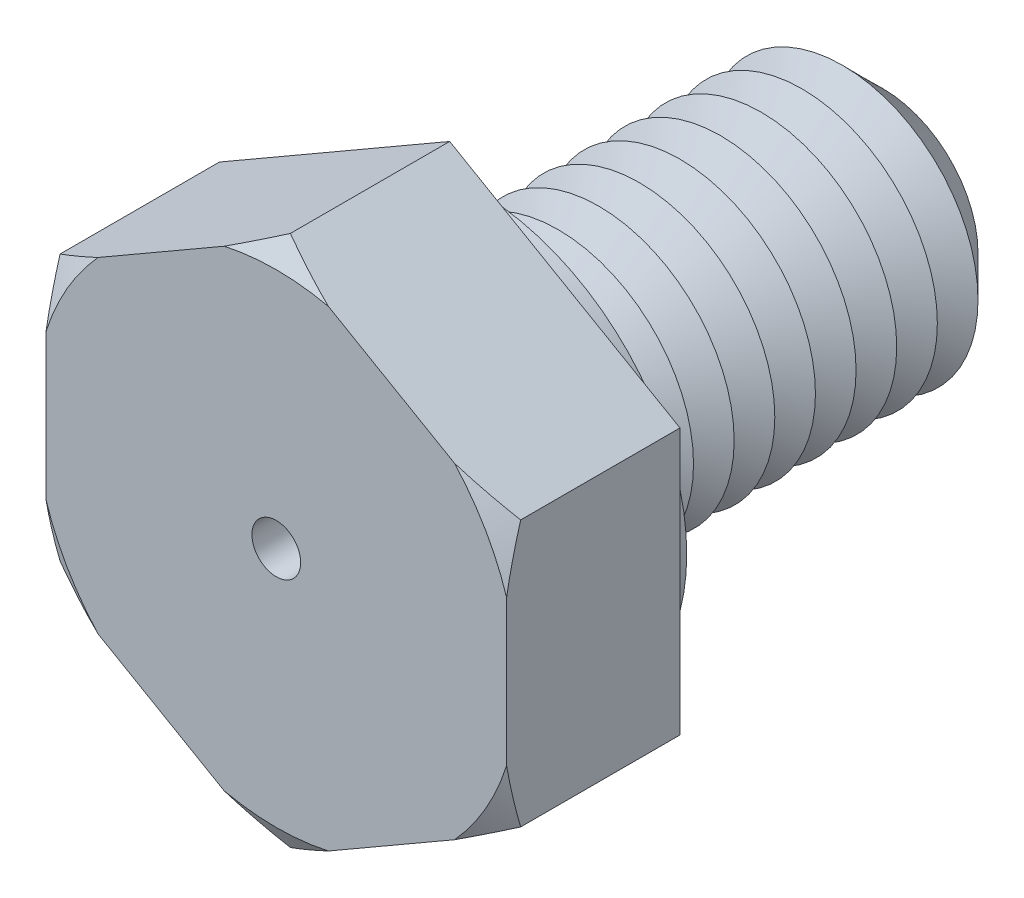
ISO-10303-21;
HEADER;
FILE_DESCRIPTION(('STEP AP214'),'2;1');
FILE_NAME('part.step','',(''),(''),'','','');
FILE_SCHEMA(('AUTOMOTIVE_DESIGN { 1 0 10303 214 1 1 1 1 }'));
ENDSEC;
DATA;
#1=APPLICATION_CONTEXT('core data for automotive mechanical design processes');
#2=APPLICATION_PROTOCOL_DEFINITION('international standard','automotive_design',2000,#1);
#3=PRODUCT_CONTEXT('',#1,'mechanical');
#4=PRODUCT('Part','Part','',(#3));
#5=PRODUCT_RELATED_PRODUCT_CATEGORY('part','',(#4));
#6=PRODUCT_DEFINITION_FORMATION('','',#4);
#7=PRODUCT_DEFINITION_CONTEXT('part definition',#1,'design');
#8=PRODUCT_DEFINITION('design','',#6,#7);
#9=PRODUCT_DEFINITION_SHAPE('','',#8);
#10=(LENGTH_UNIT() NAMED_UNIT(*) SI_UNIT(.MILLI.,.METRE.));
#11=(NAMED_UNIT(*) PLANE_ANGLE_UNIT() SI_UNIT($,.RADIAN.));
#12=(NAMED_UNIT(*) SI_UNIT($,.STERADIAN.) SOLID_ANGLE_UNIT());
#13=UNCERTAINTY_MEASURE_WITH_UNIT(LENGTH_MEASURE(1.E-05),#10,'distance_accuracy_value','');
#14=(GEOMETRIC_REPRESENTATION_CONTEXT(3) GLOBAL_UNCERTAINTY_ASSIGNED_CONTEXT((#13)) GLOBAL_UNIT_ASSIGNED_CONTEXT((#10,
#11,#12)) REPRESENTATION_CONTEXT('',''));
#15=CARTESIAN_POINT('',(0.,0.,0.));
#16=DIRECTION('',(0.,0.,1.));
#17=DIRECTION('',(1.,0.,0.));
#18=AXIS2_PLACEMENT_3D('',#15,#16,#17);
#19=CARTESIAN_POINT('',(8.5,4.90747728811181,6.4));
#20=DIRECTION('',(-0.5,-0.866025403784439,0.));
#21=DIRECTION('',(0.866025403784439,-0.5,0.));
#22=AXIS2_PLACEMENT_3D('',#19,#20,#21);
#23=PLANE('',#22);
#24=CARTESIAN_POINT('',(14.3974196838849,1.50260044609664,3.18954977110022));
#25=CARTESIAN_POINT('',(14.1303849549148,1.65677301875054,3.33361874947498));
#26=CARTESIAN_POINT('',(13.8627107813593,1.81131477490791,3.47613168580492));
#27=CARTESIAN_POINT('',(13.3258139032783,2.12129233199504,3.75731467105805));
#28=CARTESIAN_POINT('',(13.0565910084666,2.27672824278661,3.89598423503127));
#29=CARTESIAN_POINT('',(12.5155257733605,2.58911240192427,4.16915145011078));
#30=CARTESIAN_POINT('',(12.2436777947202,2.74606390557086,4.30363425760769));
#31=CARTESIAN_POINT('',(11.697943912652,3.06114350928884,4.56695627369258));
#32=CARTESIAN_POINT('',(11.4240580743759,3.21927157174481,4.69579566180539));
#33=CARTESIAN_POINT('',(10.8669438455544,3.54092162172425,4.94977636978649));
#34=CARTESIAN_POINT('',(10.5836547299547,3.70447866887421,5.07474091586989));
#35=CARTESIAN_POINT('',(10.0142178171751,4.03324322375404,5.31575754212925));
#36=CARTESIAN_POINT('',(9.72806988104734,4.19845081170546,5.43180918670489));
#37=CARTESIAN_POINT('',(9.15284957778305,4.53055440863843,5.6527883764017));
#38=CARTESIAN_POINT('',(8.86378033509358,4.69744861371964,5.75772666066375));
#39=CARTESIAN_POINT('',(8.28224800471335,5.03319646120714,5.95405449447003));
#40=CARTESIAN_POINT('',(7.98978536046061,5.20204984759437,6.04544579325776));
#41=CARTESIAN_POINT('',(7.29029341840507,5.60590170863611,6.24311258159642));
#42=CARTESIAN_POINT('',(6.88163396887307,5.84184135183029,6.34201308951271));
#43=CARTESIAN_POINT('',(6.2644717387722,6.1981601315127,6.46082851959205));
#44=CARTESIAN_POINT('',(6.05806549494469,6.31732883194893,6.49551015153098));
#45=CARTESIAN_POINT('',(5.64409758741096,6.55633331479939,6.55416143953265));
#46=CARTESIAN_POINT('',(5.43653593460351,6.67616909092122,6.57813119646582));
#47=CARTESIAN_POINT('',(5.02306823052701,6.914884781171,6.6144556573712));
#48=CARTESIAN_POINT('',(4.81717088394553,7.03375966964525,6.62694180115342));
#49=CARTESIAN_POINT('',(4.40509314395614,7.27167286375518,6.64040244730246));
#50=CARTESIAN_POINT('',(4.19891275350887,7.39071116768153,6.64137706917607));
#51=CARTESIAN_POINT('',(3.78675559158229,7.62867021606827,6.63178359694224));
#52=CARTESIAN_POINT('',(3.58077881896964,7.747590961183,6.62121556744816));
#53=CARTESIAN_POINT('',(3.16946579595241,7.9850626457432,6.58885652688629));
#54=CARTESIAN_POINT('',(2.96412965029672,8.10361352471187,6.56706376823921));
#55=CARTESIAN_POINT('',(2.47890311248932,8.38375919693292,6.50285520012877));
#56=CARTESIAN_POINT('',(2.19947000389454,8.54508997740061,6.45579627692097));
#57=CARTESIAN_POINT('',(1.6432817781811,8.86620539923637,6.34397240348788));
#58=CARTESIAN_POINT('',(1.36652705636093,9.02598981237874,6.27920487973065));
#59=CARTESIAN_POINT('',(0.815728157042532,9.34399370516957,6.13440902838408));
#60=CARTESIAN_POINT('',(0.541687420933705,9.50221119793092,6.05436342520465));
#61=CARTESIAN_POINT('',(-0.00331670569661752,9.81686947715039,5.88153285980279));
#62=CARTESIAN_POINT('',(-0.274280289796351,9.97331037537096,5.788748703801));
#63=CARTESIAN_POINT('',(-0.816522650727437,10.2863741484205,5.59147835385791));
#64=CARTESIAN_POINT('',(-1.08776675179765,10.4429770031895,5.48686595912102));
#65=CARTESIAN_POINT('',(-1.62738149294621,10.7545237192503,5.26886764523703));
#66=CARTESIAN_POINT('',(-1.89575390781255,10.9094686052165,5.15548754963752));
#67=CARTESIAN_POINT('',(-2.43005320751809,11.2179464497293,4.92150983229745));
#68=CARTESIAN_POINT('',(-2.69598059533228,11.3714796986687,4.80091373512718));
#69=CARTESIAN_POINT('',(-3.22575115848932,11.6773428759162,4.55376737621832));
#70=CARTESIAN_POINT('',(-3.48959429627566,11.829672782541,4.42721700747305));
#71=CARTESIAN_POINT('',(-3.9337259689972,12.0860923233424,4.20929972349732));
#72=CARTESIAN_POINT('',(-4.11449197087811,12.1904576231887,4.11922480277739));
#73=CARTESIAN_POINT('',(-4.47523725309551,12.3987340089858,3.93701701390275));
#74=CARTESIAN_POINT('',(-4.6552165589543,12.5026451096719,3.84488421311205));
#75=CARTESIAN_POINT('',(-5.01258669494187,12.7089728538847,3.65977671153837));
#76=CARTESIAN_POINT('',(-5.18998489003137,12.8113937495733,3.56682094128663));
#77=CARTESIAN_POINT('',(-5.54415606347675,13.0158745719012,3.3793246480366));
#78=CARTESIAN_POINT('',(-5.72092903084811,13.1179344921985,3.28478409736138));
#79=CARTESIAN_POINT('',(-5.89741968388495,13.2198314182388,3.18954977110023));
#80=B_SPLINE_CURVE_WITH_KNOTS('',3,(#24,#25,#26,#27,#28,#29,#30,#31,#32,#33,#34,#35,#36,#37,#38,
#39,#40,#41,#42,#43,#44,#45,#46,#47,#48,#49,#50,#51,#52,#53,#54,#55,#56,#57,#58,#59,#60,#61,#62,
#63,#64,#65,#66,#67,#68,#69,#70,#71,#72,#73,#74,#75,#76,#77,#78,#79),.UNSPECIFIED.,.F.,.F.,(4,2,
2,2,2,2,2,2,2,2,2,2,2,2,2,2,2,2,2,2,2,2,2,2,2,2,2,4),(0.,1.02103660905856,2.04220146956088,
3.06664888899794,4.09106369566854,5.1414707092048,6.19192902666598,7.24136281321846,
8.29066097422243,9.73548564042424,10.45782862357,11.1801648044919,11.8941264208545,
12.6080806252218,13.3220308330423,14.036092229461,15.0137259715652,15.9915018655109,
16.9703899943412,17.9492161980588,18.939699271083,19.9295300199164,20.9191523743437,
21.9087925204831,22.5907917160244,23.272768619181,23.947601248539,24.622445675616),.UNSPECIFIED.);
#81=CARTESIAN_POINT('',(8.5,4.90747728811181,5.88038475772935));
#82=VERTEX_POINT('',#81);
#83=CARTESIAN_POINT('',(6.57804882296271,6.01711631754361,6.4));
#84=VERTEX_POINT('',#83);
#85=EDGE_CURVE('E132',#82,#84,#80,.T.);
#86=ORIENTED_EDGE('',*,*,#85,.F.);
#87=DIRECTION('',(0.,0.,-1.));
#88=VECTOR('',#87,1.);
#89=CARTESIAN_POINT('',(8.5,4.90747728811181,6.4));
#90=LINE('',#89,#88);
#91=CARTESIAN_POINT('',(8.5,4.90747728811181,0.));
#92=VERTEX_POINT('',#91);
#93=EDGE_CURVE('E144',#82,#92,#90,.T.);
#94=ORIENTED_EDGE('',*,*,#93,.T.);
#95=DIRECTION('',(-0.866025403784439,0.5,0.));
#96=VECTOR('',#95,1.);
#97=CARTESIAN_POINT('',(8.5,4.90747728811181,0.));
#98=LINE('',#97,#96);
#99=CARTESIAN_POINT('',(0.,9.81495457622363,0.));
#100=VERTEX_POINT('',#99);
#101=EDGE_CURVE('E236',#92,#100,#98,.T.);
#102=ORIENTED_EDGE('',*,*,#101,.T.);
#103=DIRECTION('',(0.,0.,-1.));
#104=VECTOR('',#103,1.);
#105=CARTESIAN_POINT('',(0.,9.81495457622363,6.4));
#106=LINE('',#105,#104);
#107=CARTESIAN_POINT('',(0.,9.81495457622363,5.88038475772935));
#108=VERTEX_POINT('',#107);
#109=EDGE_CURVE('E179',#108,#100,#106,.T.);
#110=ORIENTED_EDGE('',*,*,#109,.F.);
#111=CARTESIAN_POINT('',(1.92195117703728,8.70531554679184,6.4));
#112=VERTEX_POINT('',#111);
#113=EDGE_CURVE('E151',#112,#108,#80,.T.);
#114=ORIENTED_EDGE('',*,*,#113,.F.);
#115=DIRECTION('',(-0.866025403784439,0.5,0.));
#116=VECTOR('',#115,1.);
#117=CARTESIAN_POINT('',(8.5,4.90747728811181,6.4));
#118=LINE('',#117,#116);
#119=EDGE_CURVE('E148',#84,#112,#118,.T.);
#120=ORIENTED_EDGE('',*,*,#119,.F.);
#121=EDGE_LOOP('',(#86,#94,#102,#110,#114,#120));
#122=FACE_BOUND('',#121,.T.);
#123=ADVANCED_FACE('F39',(#122),#23,.F.);
#124=CARTESIAN_POINT('',(0.,9.81495457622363,6.4));
#125=DIRECTION('',(0.5,-0.866025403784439,0.));
#126=DIRECTION('',(0.866025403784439,0.5,0.));
#127=AXIS2_PLACEMENT_3D('',#124,#125,#126);
#128=PLANE('',#127);
#129=CARTESIAN_POINT('',(5.89741968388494,13.2198314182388,3.18954977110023));
#130=CARTESIAN_POINT('',(5.63038495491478,13.0656588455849,3.33361874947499));
#131=CARTESIAN_POINT('',(5.36271078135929,12.9111170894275,3.47613168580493));
#132=CARTESIAN_POINT('',(4.82581390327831,12.6011395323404,3.75731467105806));
#133=CARTESIAN_POINT('',(4.55659100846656,12.4457036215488,3.89598423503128));
#134=CARTESIAN_POINT('',(4.01552577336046,12.1333194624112,4.16915145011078));
#135=CARTESIAN_POINT('',(3.74367779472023,11.9763679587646,4.30363425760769));
#136=CARTESIAN_POINT('',(3.19794391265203,11.6612883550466,4.56695627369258));
#137=CARTESIAN_POINT('',(2.92405807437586,11.5031602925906,4.69579566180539));
#138=CARTESIAN_POINT('',(2.3669438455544,11.1815102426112,4.9497763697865));
#139=CARTESIAN_POINT('',(2.08365472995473,11.0179531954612,5.0747409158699));
#140=CARTESIAN_POINT('',(1.51421781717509,10.6891886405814,5.31575754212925));
#141=CARTESIAN_POINT('',(1.22806988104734,10.52398105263,5.4318091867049));
#142=CARTESIAN_POINT('',(0.652849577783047,10.191877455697,5.6527883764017));
#143=CARTESIAN_POINT('',(0.363780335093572,10.0249832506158,5.75772666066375));
#144=CARTESIAN_POINT('',(-0.21775199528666,9.6892354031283,5.95405449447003));
#145=CARTESIAN_POINT('',(-0.510214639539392,9.52038201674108,6.04544579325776));
#146=CARTESIAN_POINT('',(-1.20970658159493,9.11653015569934,6.24311258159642));
#147=CARTESIAN_POINT('',(-1.61836603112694,8.88059051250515,6.34201308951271));
#148=CARTESIAN_POINT('',(-2.2355282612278,8.52427173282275,6.46082851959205));
#149=CARTESIAN_POINT('',(-2.44193450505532,8.40510303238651,6.49551015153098));
#150=CARTESIAN_POINT('',(-2.85590241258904,8.16609854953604,6.55416143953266));
#151=CARTESIAN_POINT('',(-3.0634640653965,8.04626277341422,6.57813119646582));
#152=CARTESIAN_POINT('',(-3.47693176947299,7.80754708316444,6.6144556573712));
#153=CARTESIAN_POINT('',(-3.68282911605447,7.68867219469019,6.62694180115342));
#154=CARTESIAN_POINT('',(-4.09490685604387,7.45075900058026,6.64040244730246));
#155=CARTESIAN_POINT('',(-4.30108724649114,7.33172069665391,6.64137706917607));
#156=CARTESIAN_POINT('',(-4.71324440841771,7.09376164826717,6.63178359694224));
#157=CARTESIAN_POINT('',(-4.91922118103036,6.97484090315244,6.62121556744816));
#158=CARTESIAN_POINT('',(-5.3305342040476,6.73736921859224,6.58885652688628));
#159=CARTESIAN_POINT('',(-5.53587034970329,6.61881833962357,6.5670637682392));
#160=CARTESIAN_POINT('',(-6.02109688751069,6.33867266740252,6.50285520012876));
#161=CARTESIAN_POINT('',(-6.30052999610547,6.17734188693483,6.45579627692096));
#162=CARTESIAN_POINT('',(-6.85671822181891,5.85622646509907,6.34397240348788));
#163=CARTESIAN_POINT('',(-7.13347294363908,5.6964420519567,6.27920487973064));
#164=CARTESIAN_POINT('',(-7.68427184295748,5.37843815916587,6.13440902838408));
#165=CARTESIAN_POINT('',(-7.9583125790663,5.22022066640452,6.05436342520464));
#166=CARTESIAN_POINT('',(-8.50331670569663,4.90556238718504,5.88153285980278));
#167=CARTESIAN_POINT('',(-8.77428028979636,4.74912148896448,5.78874870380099));
#168=CARTESIAN_POINT('',(-9.31652265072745,4.4360577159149,5.59147835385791));
#169=CARTESIAN_POINT('',(-9.58776675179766,4.27945486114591,5.48686595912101));
#170=CARTESIAN_POINT('',(-10.1273814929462,3.9679081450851,5.26886764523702));
#171=CARTESIAN_POINT('',(-10.3957539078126,3.81296325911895,5.15548754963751));
#172=CARTESIAN_POINT('',(-10.9300532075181,3.50448541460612,4.92150983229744));
#173=CARTESIAN_POINT('',(-11.1959805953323,3.35095216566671,4.80091373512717));
#174=CARTESIAN_POINT('',(-11.7257511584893,3.04508898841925,4.55376737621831));
#175=CARTESIAN_POINT('',(-11.9895942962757,2.89275908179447,4.42721700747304));
#176=CARTESIAN_POINT('',(-12.4337259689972,2.63633954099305,4.20929972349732));
#177=CARTESIAN_POINT('',(-12.6144919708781,2.53197424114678,4.11922480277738));
#178=CARTESIAN_POINT('',(-12.9752372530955,2.32369785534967,3.93701701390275));
#179=CARTESIAN_POINT('',(-13.1552165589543,2.21978675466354,3.84488421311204));
#180=CARTESIAN_POINT('',(-13.5125866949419,2.01345901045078,3.65977671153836));
#181=CARTESIAN_POINT('',(-13.6899848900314,1.91103811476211,3.56682094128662));
#182=CARTESIAN_POINT('',(-14.0441560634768,1.70655729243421,3.37932464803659));
#183=CARTESIAN_POINT('',(-14.2209290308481,1.60449737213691,3.28478409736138));
#184=CARTESIAN_POINT('',(-14.3974196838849,1.50260044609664,3.18954977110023));
#185=B_SPLINE_CURVE_WITH_KNOTS('',3,(#129,#130,#131,#132,#133,#134,#135,#136,#137,#138,#139,
#140,#141,#142,#143,#144,#145,#146,#147,#148,#149,#150,#151,#152,#153,#154,#155,#156,#157,#158,
#159,#160,#161,#162,#163,#164,#165,#166,#167,#168,#169,#170,#171,#172,#173,#174,#175,#176,#177,
#178,#179,#180,#181,#182,#183,#184),.UNSPECIFIED.,.F.,.F.,(4,2,2,2,2,2,2,2,2,2,2,2,2,2,2,2,2,2,
2,2,2,2,2,2,2,2,2,4),(0.,1.02103660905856,2.04220146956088,3.06664888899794,4.09106369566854,
5.14147070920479,6.19192902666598,7.24136281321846,8.29066097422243,9.73548564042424,
10.45782862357,11.1801648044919,11.8941264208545,12.6080806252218,13.3220308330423,
14.036092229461,15.0137259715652,15.991501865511,16.9703899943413,17.9492161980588,
18.939699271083,19.9295300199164,20.9191523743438,21.9087925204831,22.5907917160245,
23.272768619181,23.947601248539,24.622445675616),.UNSPECIFIED.);
#186=CARTESIAN_POINT('',(-1.92195117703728,8.70531554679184,6.4));
#187=VERTEX_POINT('',#186);
#188=EDGE_CURVE('E341',#108,#187,#185,.T.);
#189=ORIENTED_EDGE('',*,*,#188,.F.);
#190=ORIENTED_EDGE('',*,*,#109,.T.);
#191=DIRECTION('',(-0.866025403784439,-0.5,0.));
#192=VECTOR('',#191,1.);
#193=CARTESIAN_POINT('',(0.,9.81495457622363,0.));
#194=LINE('',#193,#192);
#195=CARTESIAN_POINT('',(-8.5,4.90747728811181,0.));
#196=VERTEX_POINT('',#195);
#197=EDGE_CURVE('E239',#100,#196,#194,.T.);
#198=ORIENTED_EDGE('',*,*,#197,.T.);
#199=DIRECTION('',(0.,0.,-1.));
#200=VECTOR('',#199,1.);
#201=CARTESIAN_POINT('',(-8.5,4.90747728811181,6.4));
#202=LINE('',#201,#200);
#203=CARTESIAN_POINT('',(-8.5,4.90747728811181,5.88038475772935));
#204=VERTEX_POINT('',#203);
#205=EDGE_CURVE('E176',#204,#196,#202,.T.);
#206=ORIENTED_EDGE('',*,*,#205,.F.);
#207=CARTESIAN_POINT('',(-6.57804882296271,6.01711631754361,6.4));
#208=VERTEX_POINT('',#207);
#209=EDGE_CURVE('E333',#208,#204,#185,.T.);
#210=ORIENTED_EDGE('',*,*,#209,.F.);
#211=DIRECTION('',(-0.866025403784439,-0.5,0.));
#212=VECTOR('',#211,1.);
#213=CARTESIAN_POINT('',(0.,9.81495457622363,6.4));
#214=LINE('',#213,#212);
#215=EDGE_CURVE('E213',#187,#208,#214,.T.);
#216=ORIENTED_EDGE('',*,*,#215,.F.);
#217=EDGE_LOOP('',(#189,#190,#198,#206,#210,#216));
#218=FACE_BOUND('',#217,.T.);
#219=ADVANCED_FACE('F347',(#218),#128,.F.);
#220=CARTESIAN_POINT('',(-8.5,4.90747728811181,6.4));
#221=DIRECTION('',(1.,0.,0.));
#222=DIRECTION('',(0.,0.,-1.));
#223=AXIS2_PLACEMENT_3D('',#220,#221,#222);
#224=PLANE('',#223);
#225=CARTESIAN_POINT('',(-8.5,10.8048969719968,3.60988571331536));
#226=CARTESIAN_POINT('',(-8.5,10.4978348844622,3.74918346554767));
#227=CARTESIAN_POINT('',(-8.5,10.189932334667,3.88666386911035));
#228=CARTESIAN_POINT('',(-8.5,9.57208629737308,4.15710808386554));
#229=CARTESIAN_POINT('',(-8.5,9.26214245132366,4.29007107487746));
#230=CARTESIAN_POINT('',(-8.5,8.6386633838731,4.55109231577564));
#231=CARTESIAN_POINT('',(-8.5,8.32511856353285,4.67912772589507));
#232=CARTESIAN_POINT('',(-8.5,7.69537699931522,4.92848462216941));
#233=CARTESIAN_POINT('',(-8.5,7.37918037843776,5.04980641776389));
#234=CARTESIAN_POINT('',(-8.5,6.74517674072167,5.28371307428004));
#235=CARTESIAN_POINT('',(-8.5,6.42738342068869,5.39633487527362));
#236=CARTESIAN_POINT('',(-8.5,5.78839893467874,5.61161420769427));
#237=CARTESIAN_POINT('',(-8.5,5.46720760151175,5.7142712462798));
#238=CARTESIAN_POINT('',(-8.5,4.82159629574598,5.90726308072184));
#239=CARTESIAN_POINT('',(-8.5,4.49718135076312,5.99761456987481));
#240=CARTESIAN_POINT('',(-8.5,3.84456693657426,6.16359045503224));
#241=CARTESIAN_POINT('',(-8.5,3.51636763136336,6.23921548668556));
#242=CARTESIAN_POINT('',(-8.5,2.94974096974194,6.35404738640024));
#243=CARTESIAN_POINT('',(-8.5,2.7121746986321,6.39750509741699));
#244=CARTESIAN_POINT('',(-8.5,2.23545236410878,6.47441576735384));
#245=CARTESIAN_POINT('',(-8.5,1.99629657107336,6.50787038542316));
#246=CARTESIAN_POINT('',(-8.5,1.51674855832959,6.56389930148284));
#247=CARTESIAN_POINT('',(-8.5,1.27635657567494,6.58647561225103));
#248=CARTESIAN_POINT('',(-8.5,0.794760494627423,6.62010098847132));
#249=CARTESIAN_POINT('',(-8.5,0.553556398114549,6.63115008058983));
#250=CARTESIAN_POINT('',(-8.5,0.0710159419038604,6.64137634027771));
#251=CARTESIAN_POINT('',(-8.5,-0.170320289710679,6.64055949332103));
#252=CARTESIAN_POINT('',(-8.5,-0.65265778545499,6.62709447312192));
#253=CARTESIAN_POINT('',(-8.5,-0.893659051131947,6.6144463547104));
#254=CARTESIAN_POINT('',(-8.5,-1.37480632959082,6.57770491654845));
#255=CARTESIAN_POINT('',(-8.5,-1.61495224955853,6.55361039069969));
#256=CARTESIAN_POINT('',(-8.5,-2.09391419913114,6.49466927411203));
#257=CARTESIAN_POINT('',(-8.5,-2.33273017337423,6.4598222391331));
#258=CARTESIAN_POINT('',(-8.5,-2.92716537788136,6.36046793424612));
#259=CARTESIAN_POINT('',(-8.5,-3.28176466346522,6.28983043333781));
#260=CARTESIAN_POINT('',(-8.5,-3.98672843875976,6.12983266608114));
#261=CARTESIAN_POINT('',(-8.5,-4.3370917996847,6.0404675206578));
#262=CARTESIAN_POINT('',(-8.5,-5.0342542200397,5.84616571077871));
#263=CARTESIAN_POINT('',(-8.5,-5.3810438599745,5.74119557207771));
#264=CARTESIAN_POINT('',(-8.5,-6.07054103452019,5.51879279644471));
#265=CARTESIAN_POINT('',(-8.5,-6.41324885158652,5.40136102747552));
#266=CARTESIAN_POINT('',(-8.5,-7.09891821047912,5.15508322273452));
#267=CARTESIAN_POINT('',(-8.5,-7.44183833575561,5.02612259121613));
#268=CARTESIAN_POINT('',(-8.5,-8.12447486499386,4.75996128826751));
#269=CARTESIAN_POINT('',(-8.5,-8.46419106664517,4.62276010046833));
#270=CARTESIAN_POINT('',(-8.5,-9.13876623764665,4.34260011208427));
#271=CARTESIAN_POINT('',(-8.5,-9.47364225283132,4.19968216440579));
#272=CARTESIAN_POINT('',(-8.5,-10.1409696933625,3.90850505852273));
#273=CARTESIAN_POINT('',(-8.5,-10.4734216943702,3.76024722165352));
#274=CARTESIAN_POINT('',(-8.5,-10.8048969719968,3.60988571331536));
#275=B_SPLINE_CURVE_WITH_KNOTS('',3,(#225,#226,#227,#228,#229,#230,#231,#232,#233,#234,#235,
#236,#237,#238,#239,#240,#241,#242,#243,#244,#245,#246,#247,#248,#249,#250,#251,#252,#253,#254,
#255,#256,#257,#258,#259,#260,#261,#262,#263,#264,#265,#266,#267,#268,#269,#270,#271,#272,#273,
#274),.UNSPECIFIED.,.F.,.F.,(4,2,2,2,2,2,2,2,2,2,2,2,2,2,2,2,2,2,2,2,2,2,2,2,4),(0.,
1.01155870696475,2.02330010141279,3.03927305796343,4.05519914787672,5.06654285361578,
6.07793655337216,7.08794426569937,8.09790837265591,8.82224854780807,9.5464685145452,
10.2705544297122,10.9946386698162,11.7183576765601,12.4420733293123,13.1658652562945,
13.8896870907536,14.9737367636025,16.0580692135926,17.1447621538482,18.2313794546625,
19.3303511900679,20.4293918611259,21.5216359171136,22.6136115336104),.UNSPECIFIED.);
#276=CARTESIAN_POINT('',(-8.5,2.68819922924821,6.4));
#277=VERTEX_POINT('',#276);
#278=EDGE_CURVE('E220',#204,#277,#275,.T.);
#279=ORIENTED_EDGE('',*,*,#278,.F.);
#280=ORIENTED_EDGE('',*,*,#205,.T.);
#281=DIRECTION('',(0.,-1.,0.));
#282=VECTOR('',#281,1.);
#283=CARTESIAN_POINT('',(-8.5,4.90747728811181,0.));
#284=LINE('',#283,#282);
#285=CARTESIAN_POINT('',(-8.5,-4.90747728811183,0.));
#286=VERTEX_POINT('',#285);
#287=EDGE_CURVE('E244',#196,#286,#284,.T.);
#288=ORIENTED_EDGE('',*,*,#287,.T.);
#289=DIRECTION('',(0.,0.,-1.));
#290=VECTOR('',#289,1.);
#291=CARTESIAN_POINT('',(-8.5,-4.90747728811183,6.4));
#292=LINE('',#291,#290);
#293=CARTESIAN_POINT('',(-8.49999999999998,-4.90747728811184,5.88038475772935));
#294=VERTEX_POINT('',#293);
#295=EDGE_CURVE('E173',#294,#286,#292,.T.);
#296=ORIENTED_EDGE('',*,*,#295,.F.);
#297=CARTESIAN_POINT('',(-8.5,-2.68819922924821,6.4));
#298=VERTEX_POINT('',#297);
#299=EDGE_CURVE('E223',#298,#294,#275,.T.);
#300=ORIENTED_EDGE('',*,*,#299,.F.);
#301=DIRECTION('',(0.,-1.,0.));
#302=VECTOR('',#301,1.);
#303=CARTESIAN_POINT('',(-8.5,4.90747728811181,6.4));
#304=LINE('',#303,#302);
#305=EDGE_CURVE('E211',#277,#298,#304,.T.);
#306=ORIENTED_EDGE('',*,*,#305,.F.);
#307=EDGE_LOOP('',(#279,#280,#288,#296,#300,#306));
#308=FACE_BOUND('',#307,.T.);
#309=ADVANCED_FACE('F219',(#308),#224,.F.);
#310=CARTESIAN_POINT('',(-8.5,-4.90747728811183,6.4));
#311=DIRECTION('',(0.5,0.866025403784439,0.));
#312=DIRECTION('',(-0.866025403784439,0.5,0.));
#313=AXIS2_PLACEMENT_3D('',#310,#311,#312);
#314=PLANE('',#313);
#315=CARTESIAN_POINT('',(-14.3974196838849,-1.50260044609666,3.18954977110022));
#316=CARTESIAN_POINT('',(-14.1303849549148,-1.65677301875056,3.33361874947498));
#317=CARTESIAN_POINT('',(-13.8627107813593,-1.81131477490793,3.47613168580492));
#318=CARTESIAN_POINT('',(-13.3258139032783,-2.12129233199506,3.75731467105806));
#319=CARTESIAN_POINT('',(-13.0565910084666,-2.27672824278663,3.89598423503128));
#320=CARTESIAN_POINT('',(-12.5155257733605,-2.58911240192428,4.16915145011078));
#321=CARTESIAN_POINT('',(-12.2436777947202,-2.74606390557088,4.30363425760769));
#322=CARTESIAN_POINT('',(-11.697943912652,-3.06114350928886,4.56695627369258));
#323=CARTESIAN_POINT('',(-11.4240580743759,-3.21927157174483,4.69579566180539));
#324=CARTESIAN_POINT('',(-10.8669438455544,-3.54092162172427,4.94977636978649));
#325=CARTESIAN_POINT('',(-10.5836547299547,-3.70447866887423,5.07474091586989));
#326=CARTESIAN_POINT('',(-10.0142178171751,-4.03324322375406,5.31575754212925));
#327=CARTESIAN_POINT('',(-9.72806988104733,-4.19845081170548,5.43180918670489));
#328=CARTESIAN_POINT('',(-9.15284957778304,-4.53055440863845,5.65278837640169));
#329=CARTESIAN_POINT('',(-8.86378033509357,-4.69744861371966,5.75772666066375));
#330=CARTESIAN_POINT('',(-8.28224800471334,-5.03319646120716,5.95405449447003));
#331=CARTESIAN_POINT('',(-7.9897853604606,-5.20204984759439,6.04544579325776));
#332=CARTESIAN_POINT('',(-7.29029341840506,-5.60590170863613,6.24311258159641));
#333=CARTESIAN_POINT('',(-6.88163396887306,-5.84184135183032,6.34201308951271));
#334=CARTESIAN_POINT('',(-6.26447173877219,-6.19816013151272,6.46082851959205));
#335=CARTESIAN_POINT('',(-6.05806549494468,-6.31732883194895,6.49551015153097));
#336=CARTESIAN_POINT('',(-5.64409758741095,-6.55633331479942,6.55416143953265));
#337=CARTESIAN_POINT('',(-5.4365359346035,-6.67616909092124,6.57813119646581));
#338=CARTESIAN_POINT('',(-5.023068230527,-6.91488478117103,6.6144556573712));
#339=CARTESIAN_POINT('',(-4.81717088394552,-7.03375966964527,6.62694180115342));
#340=CARTESIAN_POINT('',(-4.40509314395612,-7.2716728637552,6.64040244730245));
#341=CARTESIAN_POINT('',(-4.19891275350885,-7.39071116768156,6.64137706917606));
#342=CARTESIAN_POINT('',(-3.78675559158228,-7.6286702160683,6.63178359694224));
#343=CARTESIAN_POINT('',(-3.58077881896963,-7.74759096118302,6.62121556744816));
#344=CARTESIAN_POINT('',(-3.16946579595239,-7.98506264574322,6.58885652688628));
#345=CARTESIAN_POINT('',(-2.9641296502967,-8.10361352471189,6.5670637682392));
#346=CARTESIAN_POINT('',(-2.4789031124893,-8.38375919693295,6.50285520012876));
#347=CARTESIAN_POINT('',(-2.19947000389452,-8.54508997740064,6.45579627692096));
#348=CARTESIAN_POINT('',(-1.64328177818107,-8.8662053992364,6.34397240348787));
#349=CARTESIAN_POINT('',(-1.36652705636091,-9.02598981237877,6.27920487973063));
#350=CARTESIAN_POINT('',(-0.815728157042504,-9.3439937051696,6.13440902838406));
#351=CARTESIAN_POINT('',(-0.541687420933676,-9.50221119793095,6.05436342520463));
#352=CARTESIAN_POINT('',(0.00331670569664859,-9.81686947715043,5.88153285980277));
#353=CARTESIAN_POINT('',(0.274280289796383,-9.973310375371,5.78874870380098));
#354=CARTESIAN_POINT('',(0.81652265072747,-10.2863741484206,5.59147835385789));
#355=CARTESIAN_POINT('',(1.08776675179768,-10.4429770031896,5.486865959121));
#356=CARTESIAN_POINT('',(1.62738149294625,-10.7545237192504,5.268867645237));
#357=CARTESIAN_POINT('',(1.89575390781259,-10.9094686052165,5.15548754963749));
#358=CARTESIAN_POINT('',(2.43005320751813,-11.2179464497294,4.92150983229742));
#359=CARTESIAN_POINT('',(2.69598059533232,-11.3714796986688,4.80091373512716));
#360=CARTESIAN_POINT('',(3.22575115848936,-11.6773428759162,4.55376737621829));
#361=CARTESIAN_POINT('',(3.48959429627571,-11.829672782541,4.42721700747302));
#362=CARTESIAN_POINT('',(3.93372596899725,-12.0860923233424,4.20929972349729));
#363=CARTESIAN_POINT('',(4.11449197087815,-12.1904576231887,4.11922480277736));
#364=CARTESIAN_POINT('',(4.47523725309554,-12.3987340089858,3.93701701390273));
#365=CARTESIAN_POINT('',(4.65521655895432,-12.5026451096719,3.84488421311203));
#366=CARTESIAN_POINT('',(5.01258669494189,-12.7089728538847,3.65977671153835));
#367=CARTESIAN_POINT('',(5.18998489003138,-12.8113937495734,3.56682094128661));
#368=CARTESIAN_POINT('',(5.54415606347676,-13.0158745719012,3.37932464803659));
#369=CARTESIAN_POINT('',(5.72092903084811,-13.1179344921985,3.28478409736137));
#370=CARTESIAN_POINT('',(5.89741968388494,-13.2198314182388,3.18954977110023));
#371=B_SPLINE_CURVE_WITH_KNOTS('',3,(#315,#316,#317,#318,#319,#320,#321,#322,#323,#324,#325,
#326,#327,#328,#329,#330,#331,#332,#333,#334,#335,#336,#337,#338,#339,#340,#341,#342,#343,#344,
#345,#346,#347,#348,#349,#350,#351,#352,#353,#354,#355,#356,#357,#358,#359,#360,#361,#362,#363,
#364,#365,#366,#367,#368,#369,#370),.UNSPECIFIED.,.F.,.F.,(4,2,2,2,2,2,2,2,2,2,2,2,2,2,2,2,2,2,
2,2,2,2,2,2,2,2,2,4),(0.,1.02103660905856,2.04220146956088,3.06664888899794,4.09106369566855,
5.1414707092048,6.19192902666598,7.24136281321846,8.29066097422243,9.73548564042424,
10.45782862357,11.1801648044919,11.8941264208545,12.6080806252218,13.3220308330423,
14.036092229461,15.0137259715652,15.991501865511,16.9703899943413,17.9492161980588,
18.939699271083,19.9295300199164,20.9191523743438,21.9087925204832,22.5907917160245,
23.272768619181,23.947601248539,24.622445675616),.UNSPECIFIED.);
#372=CARTESIAN_POINT('',(-6.57804882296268,-6.01711631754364,6.4));
#373=VERTEX_POINT('',#372);
#374=EDGE_CURVE('E384',#294,#373,#371,.T.);
#375=ORIENTED_EDGE('',*,*,#374,.F.);
#376=ORIENTED_EDGE('',*,*,#295,.T.);
#377=DIRECTION('',(0.866025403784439,-0.5,0.));
#378=VECTOR('',#377,1.);
#379=CARTESIAN_POINT('',(-8.5,-4.90747728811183,0.));
#380=LINE('',#379,#378);
#381=CARTESIAN_POINT('',(0.,-9.81495457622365,0.));
#382=VERTEX_POINT('',#381);
#383=EDGE_CURVE('E248',#286,#382,#380,.T.);
#384=ORIENTED_EDGE('',*,*,#383,.T.);
#385=DIRECTION('',(0.,0.,-1.));
#386=VECTOR('',#385,1.);
#387=CARTESIAN_POINT('',(0.,-9.81495457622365,6.4));
#388=LINE('',#387,#386);
#389=CARTESIAN_POINT('',(0.,-9.81495457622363,5.88038475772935));
#390=VERTEX_POINT('',#389);
#391=EDGE_CURVE('E163',#390,#382,#388,.T.);
#392=ORIENTED_EDGE('',*,*,#391,.F.);
#393=CARTESIAN_POINT('',(-1.92195117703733,-8.70531554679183,6.4));
#394=VERTEX_POINT('',#393);
#395=EDGE_CURVE('E378',#394,#390,#371,.T.);
#396=ORIENTED_EDGE('',*,*,#395,.F.);
#397=DIRECTION('',(0.866025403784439,-0.5,0.));
#398=VECTOR('',#397,1.);
#399=CARTESIAN_POINT('',(-8.5,-4.90747728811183,6.4));
#400=LINE('',#399,#398);
#401=EDGE_CURVE('E225',#373,#394,#400,.T.);
#402=ORIENTED_EDGE('',*,*,#401,.F.);
#403=EDGE_LOOP('',(#375,#376,#384,#392,#396,#402));
#404=FACE_BOUND('',#403,.T.);
#405=ADVANCED_FACE('F385',(#404),#314,.F.);
#406=CARTESIAN_POINT('',(0.,-9.81495457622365,6.4));
#407=DIRECTION('',(-0.5,0.866025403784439,0.));
#408=DIRECTION('',(-0.866025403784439,-0.5,0.));
#409=AXIS2_PLACEMENT_3D('',#406,#407,#408);
#410=PLANE('',#409);
#411=CARTESIAN_POINT('',(-5.89741968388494,-13.2198314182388,3.18954977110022));
#412=CARTESIAN_POINT('',(-5.63038495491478,-13.0656588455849,3.33361874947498));
#413=CARTESIAN_POINT('',(-5.36271078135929,-12.9111170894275,3.47613168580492));
#414=CARTESIAN_POINT('',(-4.8258139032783,-12.6011395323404,3.75731467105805));
#415=CARTESIAN_POINT('',(-4.55659100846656,-12.4457036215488,3.89598423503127));
#416=CARTESIAN_POINT('',(-4.01552577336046,-12.1333194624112,4.16915145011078));
#417=CARTESIAN_POINT('',(-3.74367779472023,-11.9763679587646,4.30363425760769));
#418=CARTESIAN_POINT('',(-3.19794391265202,-11.6612883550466,4.56695627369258));
#419=CARTESIAN_POINT('',(-2.92405807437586,-11.5031602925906,4.69579566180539));
#420=CARTESIAN_POINT('',(-2.36694384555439,-11.1815102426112,4.94977636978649));
#421=CARTESIAN_POINT('',(-2.08365472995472,-11.0179531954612,5.07474091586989));
#422=CARTESIAN_POINT('',(-1.51421781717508,-10.6891886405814,5.31575754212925));
#423=CARTESIAN_POINT('',(-1.22806988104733,-10.52398105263,5.43180918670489));
#424=CARTESIAN_POINT('',(-0.652849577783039,-10.191877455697,5.65278837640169));
#425=CARTESIAN_POINT('',(-0.363780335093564,-10.0249832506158,5.75772666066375));
#426=CARTESIAN_POINT('',(0.217751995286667,-9.68923540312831,5.95405449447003));
#427=CARTESIAN_POINT('',(0.5102146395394,-9.52038201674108,6.04544579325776));
#428=CARTESIAN_POINT('',(1.20970658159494,-9.11653015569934,6.24311258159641));
#429=CARTESIAN_POINT('',(1.61836603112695,-8.88059051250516,6.34201308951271));
#430=CARTESIAN_POINT('',(2.23552826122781,-8.52427173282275,6.46082851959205));
#431=CARTESIAN_POINT('',(2.44193450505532,-8.40510303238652,6.49551015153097));
#432=CARTESIAN_POINT('',(2.85590241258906,-8.16609854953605,6.55416143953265));
#433=CARTESIAN_POINT('',(3.06346406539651,-8.04626277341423,6.57813119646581));
#434=CARTESIAN_POINT('',(3.47693176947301,-7.80754708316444,6.61445565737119));
#435=CARTESIAN_POINT('',(3.68282911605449,-7.6886721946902,6.62694180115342));
#436=CARTESIAN_POINT('',(4.09490685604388,-7.45075900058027,6.64040244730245));
#437=CARTESIAN_POINT('',(4.30108724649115,-7.33172069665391,6.64137706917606));
#438=CARTESIAN_POINT('',(4.71324440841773,-7.09376164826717,6.63178359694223));
#439=CARTESIAN_POINT('',(4.91922118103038,-6.97484090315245,6.62121556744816));
#440=CARTESIAN_POINT('',(5.33053420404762,-6.73736921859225,6.58885652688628));
#441=CARTESIAN_POINT('',(5.5358703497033,-6.61881833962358,6.5670637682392));
#442=CARTESIAN_POINT('',(6.02109688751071,-6.33867266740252,6.50285520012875));
#443=CARTESIAN_POINT('',(6.30052999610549,-6.17734188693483,6.45579627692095));
#444=CARTESIAN_POINT('',(6.85671822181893,-5.85622646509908,6.34397240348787));
#445=CARTESIAN_POINT('',(7.1334729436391,-5.6964420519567,6.27920487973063));
#446=CARTESIAN_POINT('',(7.6842718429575,-5.37843815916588,6.13440902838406));
#447=CARTESIAN_POINT('',(7.95831257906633,-5.22022066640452,6.05436342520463));
#448=CARTESIAN_POINT('',(8.50331670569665,-4.90556238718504,5.88153285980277));
#449=CARTESIAN_POINT('',(8.77428028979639,-4.74912148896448,5.78874870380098));
#450=CARTESIAN_POINT('',(9.31652265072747,-4.4360577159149,5.59147835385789));
#451=CARTESIAN_POINT('',(9.58776675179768,-4.27945486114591,5.486865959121));
#452=CARTESIAN_POINT('',(10.1273814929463,-3.9679081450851,5.268867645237));
#453=CARTESIAN_POINT('',(10.3957539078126,-3.81296325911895,5.15548754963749));
#454=CARTESIAN_POINT('',(10.9300532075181,-3.50448541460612,4.92150983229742));
#455=CARTESIAN_POINT('',(11.1959805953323,-3.35095216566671,4.80091373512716));
#456=CARTESIAN_POINT('',(11.7257511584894,-3.04508898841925,4.5537673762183));
#457=CARTESIAN_POINT('',(11.9895942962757,-2.89275908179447,4.42721700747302));
#458=CARTESIAN_POINT('',(12.4337259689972,-2.63633954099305,4.20929972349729));
#459=CARTESIAN_POINT('',(12.6144919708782,-2.53197424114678,4.11922480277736));
#460=CARTESIAN_POINT('',(12.9752372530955,-2.32369785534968,3.93701701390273));
#461=CARTESIAN_POINT('',(13.1552165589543,-2.21978675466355,3.84488421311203));
#462=CARTESIAN_POINT('',(13.5125866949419,-2.0134590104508,3.65977671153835));
#463=CARTESIAN_POINT('',(13.6899848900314,-1.91103811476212,3.56682094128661));
#464=CARTESIAN_POINT('',(14.0441560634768,-1.70655729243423,3.37932464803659));
#465=CARTESIAN_POINT('',(14.2209290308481,-1.60449737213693,3.28478409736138));
#466=CARTESIAN_POINT('',(14.3974196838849,-1.50260044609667,3.18954977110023));
#467=B_SPLINE_CURVE_WITH_KNOTS('',3,(#411,#412,#413,#414,#415,#416,#417,#418,#419,#420,#421,
#422,#423,#424,#425,#426,#427,#428,#429,#430,#431,#432,#433,#434,#435,#436,#437,#438,#439,#440,
#441,#442,#443,#444,#445,#446,#447,#448,#449,#450,#451,#452,#453,#454,#455,#456,#457,#458,#459,
#460,#461,#462,#463,#464,#465,#466),.UNSPECIFIED.,.F.,.F.,(4,2,2,2,2,2,2,2,2,2,2,2,2,2,2,2,2,2,
2,2,2,2,2,2,2,2,2,4),(0.,1.02103660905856,2.04220146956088,3.06664888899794,4.09106369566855,
5.1414707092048,6.19192902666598,7.24136281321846,8.29066097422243,9.73548564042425,
10.45782862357,11.1801648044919,11.8941264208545,12.6080806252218,13.3220308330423,
14.036092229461,15.0137259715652,15.991501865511,16.9703899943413,17.9492161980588,
18.939699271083,19.9295300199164,20.9191523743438,21.9087925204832,22.5907917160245,
23.272768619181,23.947601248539,24.622445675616),.UNSPECIFIED.);
#468=CARTESIAN_POINT('',(1.92195117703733,-8.70531554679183,6.4));
#469=VERTEX_POINT('',#468);
#470=EDGE_CURVE('E64',#390,#469,#467,.T.);
#471=ORIENTED_EDGE('',*,*,#470,.F.);
#472=ORIENTED_EDGE('',*,*,#391,.T.);
#473=DIRECTION('',(0.866025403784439,0.5,0.));
#474=VECTOR('',#473,1.);
#475=CARTESIAN_POINT('',(0.,-9.81495457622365,0.));
#476=LINE('',#475,#474);
#477=CARTESIAN_POINT('',(8.5,-4.90747728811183,0.));
#478=VERTEX_POINT('',#477);
#479=EDGE_CURVE('E250',#382,#478,#476,.T.);
#480=ORIENTED_EDGE('',*,*,#479,.T.);
#481=DIRECTION('',(0.,0.,-1.));
#482=VECTOR('',#481,1.);
#483=CARTESIAN_POINT('',(8.5,-4.90747728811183,6.4));
#484=LINE('',#483,#482);
#485=CARTESIAN_POINT('',(8.5,-4.90747728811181,5.88038475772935));
#486=VERTEX_POINT('',#485);
#487=EDGE_CURVE('E157',#486,#478,#484,.T.);
#488=ORIENTED_EDGE('',*,*,#487,.F.);
#489=CARTESIAN_POINT('',(6.57804882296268,-6.01711631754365,6.4));
#490=VERTEX_POINT('',#489);
#491=EDGE_CURVE('E373',#490,#486,#467,.T.);
#492=ORIENTED_EDGE('',*,*,#491,.F.);
#493=DIRECTION('',(0.866025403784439,0.5,0.));
#494=VECTOR('',#493,1.);
#495=CARTESIAN_POINT('',(0.,-9.81495457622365,6.4));
#496=LINE('',#495,#494);
#497=EDGE_CURVE('E166',#469,#490,#496,.T.);
#498=ORIENTED_EDGE('',*,*,#497,.F.);
#499=EDGE_LOOP('',(#471,#472,#480,#488,#492,#498));
#500=FACE_BOUND('',#499,.T.);
#501=ADVANCED_FACE('F388',(#500),#410,.F.);
#502=CARTESIAN_POINT('',(8.5,-4.90747728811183,6.4));
#503=DIRECTION('',(-1.,0.,0.));
#504=DIRECTION('',(0.,0.,1.));
#505=AXIS2_PLACEMENT_3D('',#502,#503,#504);
#506=PLANE('',#505);
#507=CARTESIAN_POINT('',(8.5,-10.8048969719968,3.60988571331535));
#508=CARTESIAN_POINT('',(8.5,-10.4978348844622,3.74918346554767));
#509=CARTESIAN_POINT('',(8.5,-10.189932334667,3.88666386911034));
#510=CARTESIAN_POINT('',(8.5,-9.5720862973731,4.15710808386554));
#511=CARTESIAN_POINT('',(8.5,-9.26214245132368,4.29007107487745));
#512=CARTESIAN_POINT('',(8.5,-8.63866338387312,4.55109231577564));
#513=CARTESIAN_POINT('',(8.5,-8.32511856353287,4.67912772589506));
#514=CARTESIAN_POINT('',(8.5,-7.69537699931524,4.9284846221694));
#515=CARTESIAN_POINT('',(8.5,-7.37918037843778,5.04980641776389));
#516=CARTESIAN_POINT('',(8.5,-6.74517674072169,5.28371307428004));
#517=CARTESIAN_POINT('',(8.5,-6.42738342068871,5.39633487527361));
#518=CARTESIAN_POINT('',(8.5,-5.78839893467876,5.61161420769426));
#519=CARTESIAN_POINT('',(8.5,-5.46720760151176,5.71427124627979));
#520=CARTESIAN_POINT('',(8.5,-4.821596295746,5.90726308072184));
#521=CARTESIAN_POINT('',(8.5,-4.49718135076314,5.99761456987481));
#522=CARTESIAN_POINT('',(8.5,-3.84456693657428,6.16359045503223));
#523=CARTESIAN_POINT('',(8.5,-3.51636763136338,6.23921548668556));
#524=CARTESIAN_POINT('',(8.5,-2.94974096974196,6.35404738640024));
#525=CARTESIAN_POINT('',(8.5,-2.71217469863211,6.39750509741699));
#526=CARTESIAN_POINT('',(8.5,-2.2354523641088,6.47441576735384));
#527=CARTESIAN_POINT('',(8.5,-1.99629657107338,6.50787038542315));
#528=CARTESIAN_POINT('',(8.5,-1.51674855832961,6.56389930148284));
#529=CARTESIAN_POINT('',(8.5,-1.27635657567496,6.58647561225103));
#530=CARTESIAN_POINT('',(8.5,-0.794760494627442,6.62010098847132));
#531=CARTESIAN_POINT('',(8.5,-0.553556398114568,6.63115008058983));
#532=CARTESIAN_POINT('',(8.5,-0.0710159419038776,6.64137634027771));
#533=CARTESIAN_POINT('',(8.5,0.170320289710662,6.64055949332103));
#534=CARTESIAN_POINT('',(8.5,0.652657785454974,6.62709447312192));
#535=CARTESIAN_POINT('',(8.5,0.89365905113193,6.61444635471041));
#536=CARTESIAN_POINT('',(8.5,1.37480632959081,6.57770491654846));
#537=CARTESIAN_POINT('',(8.5,1.61495224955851,6.55361039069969));
#538=CARTESIAN_POINT('',(8.5,2.09391419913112,6.49466927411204));
#539=CARTESIAN_POINT('',(8.5,2.33273017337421,6.45982223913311));
#540=CARTESIAN_POINT('',(8.5,2.92716537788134,6.36046793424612));
#541=CARTESIAN_POINT('',(8.5,3.2817646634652,6.28983043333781));
#542=CARTESIAN_POINT('',(8.5,3.98672843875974,6.12983266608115));
#543=CARTESIAN_POINT('',(8.5,4.33709179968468,6.04046752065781));
#544=CARTESIAN_POINT('',(8.5,5.03425422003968,5.84616571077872));
#545=CARTESIAN_POINT('',(8.5,5.38104385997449,5.74119557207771));
#546=CARTESIAN_POINT('',(8.5,6.07054103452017,5.51879279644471));
#547=CARTESIAN_POINT('',(8.5,6.4132488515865,5.40136102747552));
#548=CARTESIAN_POINT('',(8.5,7.0989182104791,5.15508322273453));
#549=CARTESIAN_POINT('',(8.5,7.4418383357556,5.02612259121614));
#550=CARTESIAN_POINT('',(8.5,8.12447486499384,4.75996128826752));
#551=CARTESIAN_POINT('',(8.5,8.46419106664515,4.62276010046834));
#552=CARTESIAN_POINT('',(8.5,9.13876623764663,4.34260011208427));
#553=CARTESIAN_POINT('',(8.5,9.47364225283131,4.19968216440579));
#554=CARTESIAN_POINT('',(8.5,10.1409696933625,3.90850505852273));
#555=CARTESIAN_POINT('',(8.5,10.4734216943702,3.76024722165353));
#556=CARTESIAN_POINT('',(8.5,10.8048969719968,3.60988571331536));
#557=B_SPLINE_CURVE_WITH_KNOTS('',3,(#507,#508,#509,#510,#511,#512,#513,#514,#515,#516,#517,
#518,#519,#520,#521,#522,#523,#524,#525,#526,#527,#528,#529,#530,#531,#532,#533,#534,#535,#536,
#537,#538,#539,#540,#541,#542,#543,#544,#545,#546,#547,#548,#549,#550,#551,#552,#553,#554,#555,
#556),.UNSPECIFIED.,.F.,.F.,(4,2,2,2,2,2,2,2,2,2,2,2,2,2,2,2,2,2,2,2,2,2,2,2,4),(0.,
1.01155870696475,2.02330010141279,3.03927305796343,4.05519914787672,5.06654285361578,
6.07793655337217,7.08794426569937,8.09790837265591,8.82224854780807,9.5464685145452,
10.2705544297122,10.9946386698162,11.7183576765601,12.4420733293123,13.1658652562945,
13.8896870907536,14.9737367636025,16.0580692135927,17.1447621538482,18.2313794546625,
19.3303511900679,20.4293918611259,21.5216359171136,22.6136115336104),.UNSPECIFIED.);
#558=CARTESIAN_POINT('',(8.5,-2.68819922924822,6.4));
#559=VERTEX_POINT('',#558);
#560=EDGE_CURVE('E56',#486,#559,#557,.T.);
#561=ORIENTED_EDGE('',*,*,#560,.F.);
#562=ORIENTED_EDGE('',*,*,#487,.T.);
#563=DIRECTION('',(0.,1.,0.));
#564=VECTOR('',#563,1.);
#565=CARTESIAN_POINT('',(8.5,-4.90747728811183,0.));
#566=LINE('',#565,#564);
#567=EDGE_CURVE('E154',#478,#92,#566,.T.);
#568=ORIENTED_EDGE('',*,*,#567,.T.);
#569=ORIENTED_EDGE('',*,*,#93,.F.);
#570=CARTESIAN_POINT('',(8.5,2.68819922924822,6.4));
#571=VERTEX_POINT('',#570);
#572=EDGE_CURVE('E129',#571,#82,#557,.T.);
#573=ORIENTED_EDGE('',*,*,#572,.F.);
#574=DIRECTION('',(0.,1.,0.));
#575=VECTOR('',#574,1.);
#576=CARTESIAN_POINT('',(8.5,-4.90747728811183,6.4));
#577=LINE('',#576,#575);
#578=EDGE_CURVE('E158',#559,#571,#577,.T.);
#579=ORIENTED_EDGE('',*,*,#578,.F.);
#580=EDGE_LOOP('',(#561,#562,#568,#569,#573,#579));
#581=FACE_BOUND('',#580,.T.);
#582=ADVANCED_FACE('F152',(#581),#506,.F.);
#583=CARTESIAN_POINT('',(0.,0.,6.4));
#584=DIRECTION('',(0.,0.,1.));
#585=DIRECTION('',(1.,0.,0.));
#586=AXIS2_PLACEMENT_3D('',#583,#584,#585);
#587=PLANE('',#586);
#588=CARTESIAN_POINT('',(0.,0.,6.4));
#589=DIRECTION('',(0.,0.,1.));
#590=DIRECTION('',(1.,0.,0.));
#591=AXIS2_PLACEMENT_3D('',#588,#589,#590);
#592=CIRCLE('',#591,0.9);
#593=CARTESIAN_POINT('',(0.9,0.,6.4));
#594=VERTEX_POINT('',#593);
#595=EDGE_CURVE('E762',#594,#594,#592,.T.);
#596=ORIENTED_EDGE('',*,*,#595,.F.);
#597=EDGE_LOOP('',(#596));
#598=FACE_BOUND('',#597,.T.);
#599=ORIENTED_EDGE('',*,*,#578,.T.);
#600=CARTESIAN_POINT('',(0.,0.,6.4));
#601=DIRECTION('',(0.,0.,1.));
#602=DIRECTION('',(1.,0.,0.));
#603=AXIS2_PLACEMENT_3D('',#600,#601,#602);
#604=CIRCLE('',#603,8.91495457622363);
#605=EDGE_CURVE('E134',#571,#84,#604,.T.);
#606=ORIENTED_EDGE('',*,*,#605,.T.);
#607=ORIENTED_EDGE('',*,*,#119,.T.);
#608=CARTESIAN_POINT('',(0.,0.,6.4));
#609=DIRECTION('',(0.,0.,1.));
#610=DIRECTION('',(1.,0.,0.));
#611=AXIS2_PLACEMENT_3D('',#608,#609,#610);
#612=CIRCLE('',#611,8.91495457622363);
#613=EDGE_CURVE('E11',#112,#187,#612,.T.);
#614=ORIENTED_EDGE('',*,*,#613,.T.);
#615=ORIENTED_EDGE('',*,*,#215,.T.);
#616=EDGE_CURVE('E49',#208,#277,#612,.T.);
#617=ORIENTED_EDGE('',*,*,#616,.T.);
#618=ORIENTED_EDGE('',*,*,#305,.T.);
#619=EDGE_CURVE('E198',#298,#373,#612,.T.);
#620=ORIENTED_EDGE('',*,*,#619,.T.);
#621=ORIENTED_EDGE('',*,*,#401,.T.);
#622=EDGE_CURVE('E192',#394,#469,#612,.T.);
#623=ORIENTED_EDGE('',*,*,#622,.T.);
#624=ORIENTED_EDGE('',*,*,#497,.T.);
#625=EDGE_CURVE('E43',#490,#559,#612,.T.);
#626=ORIENTED_EDGE('',*,*,#625,.T.);
#627=EDGE_LOOP('',(#599,#606,#607,#614,#615,#617,#618,#620,#621,#623,#624,#626));
#628=FACE_BOUND('',#627,.T.);
#629=ADVANCED_FACE('F210',(#598,#628),#587,.T.);
#630=CARTESIAN_POINT('',(0.,0.,0.));
#631=DIRECTION('',(0.,0.,1.));
#632=DIRECTION('',(1.,0.,0.));
#633=AXIS2_PLACEMENT_3D('',#630,#631,#632);
#634=PLANE('',#633);
#635=CARTESIAN_POINT('',(0.,0.,0.));
#636=DIRECTION('',(0.,0.,1.));
#637=DIRECTION('',(1.,0.,0.));
#638=AXIS2_PLACEMENT_3D('',#635,#636,#637);
#639=CIRCLE('',#638,7.75);
#640=CARTESIAN_POINT('',(7.75,0.,0.));
#641=VERTEX_POINT('',#640);
#642=EDGE_CURVE('E182',#641,#641,#639,.F.);
#643=ORIENTED_EDGE('',*,*,#642,.F.);
#644=EDGE_LOOP('',(#643));
#645=FACE_BOUND('',#644,.T.);
#646=ORIENTED_EDGE('',*,*,#101,.F.);
#647=ORIENTED_EDGE('',*,*,#567,.F.);
#648=ORIENTED_EDGE('',*,*,#479,.F.);
#649=ORIENTED_EDGE('',*,*,#383,.F.);
#650=ORIENTED_EDGE('',*,*,#287,.F.);
#651=ORIENTED_EDGE('',*,*,#197,.F.);
#652=EDGE_LOOP('',(#646,#647,#648,#649,#650,#651));
#653=FACE_BOUND('',#652,.T.);
#654=ADVANCED_FACE('F432',(#645,#653),#634,.F.);
#655=CARTESIAN_POINT('',(0.,0.,-1.));
#656=DIRECTION('',(0.,0.,1.));
#657=DIRECTION('',(1.,0.,0.));
#658=AXIS2_PLACEMENT_3D('',#655,#656,#657);
#659=CYLINDRICAL_SURFACE('',#658,7.75);
#660=CARTESIAN_POINT('',(0.,0.,-1.));
#661=DIRECTION('',(0.,0.,-1.));
#662=DIRECTION('',(-1.,0.,0.));
#663=AXIS2_PLACEMENT_3D('',#660,#661,#662);
#664=CIRCLE('',#663,7.75);
#665=CARTESIAN_POINT('',(-7.75,0.,-1.));
#666=VERTEX_POINT('',#665);
#667=EDGE_CURVE('E240',#666,#666,#664,.T.);
#668=ORIENTED_EDGE('',*,*,#667,.F.);
#669=EDGE_LOOP('',(#668));
#670=FACE_BOUND('',#669,.T.);
#671=ORIENTED_EDGE('',*,*,#642,.T.);
#672=EDGE_LOOP('',(#671));
#673=FACE_BOUND('',#672,.T.);
#674=ADVANCED_FACE('F443',(#670,#673),#659,.T.);
#675=CARTESIAN_POINT('',(0.,0.,-1.));
#676=DIRECTION('',(0.,0.,-1.));
#677=DIRECTION('',(-1.,0.,0.));
#678=AXIS2_PLACEMENT_3D('',#675,#676,#677);
#679=PLANE('',#678);
#680=CARTESIAN_POINT('',(0.,0.,-1.));
#681=DIRECTION('',(0.,0.,1.));
#682=DIRECTION('',(1.,0.,0.));
#683=AXIS2_PLACEMENT_3D('',#680,#681,#682);
#684=CIRCLE('',#683,5.);
#685=CARTESIAN_POINT('',(5.,0.,-1.));
#686=VERTEX_POINT('',#685);
#687=EDGE_CURVE('E265',#686,#686,#684,.T.);
#688=ORIENTED_EDGE('',*,*,#687,.T.);
#689=EDGE_LOOP('',(#688));
#690=FACE_BOUND('',#689,.T.);
#691=ORIENTED_EDGE('',*,*,#667,.T.);
#692=EDGE_LOOP('',(#691));
#693=FACE_BOUND('',#692,.T.);
#694=ADVANCED_FACE('F452',(#690,#693),#679,.T.);
#695=CARTESIAN_POINT('',(0.,0.,-1.));
#696=DIRECTION('',(0.,0.,1.));
#697=DIRECTION('',(1.,0.,0.));
#698=AXIS2_PLACEMENT_3D('',#695,#696,#697);
#699=CONICAL_SURFACE('',#698,5.,1.0471975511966);
#700=CARTESIAN_POINT('',(0.,0.,-1.75));
#701=DIRECTION('',(0.,0.,1.));
#702=DIRECTION('',(1.,0.,0.));
#703=AXIS2_PLACEMENT_3D('',#700,#701,#702);
#704=CIRCLE('',#703,3.70096189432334);
#705=CARTESIAN_POINT('',(3.70096189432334,0.,-1.75));
#706=VERTEX_POINT('',#705);
#707=EDGE_CURVE('E269',#706,#706,#704,.T.);
#708=ORIENTED_EDGE('',*,*,#707,.T.);
#709=EDGE_LOOP('',(#708));
#710=FACE_BOUND('',#709,.T.);
#711=ORIENTED_EDGE('',*,*,#687,.F.);
#712=EDGE_LOOP('',(#711));
#713=FACE_BOUND('',#712,.T.);
#714=ADVANCED_FACE('F461',(#710,#713),#699,.T.);
#715=CARTESIAN_POINT('',(0.,0.,-1.75));
#716=DIRECTION('',(0.,0.,-1.));
#717=DIRECTION('',(-1.,0.,0.));
#718=AXIS2_PLACEMENT_3D('',#715,#716,#717);
#719=CONICAL_SURFACE('',#718,3.70096189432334,1.0471975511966);
#720=CARTESIAN_POINT('',(0.,0.,-2.5));
#721=DIRECTION('',(0.,0.,1.));
#722=DIRECTION('',(1.,0.,0.));
#723=AXIS2_PLACEMENT_3D('',#720,#721,#722);
#724=CIRCLE('',#723,5.);
#725=CARTESIAN_POINT('',(5.,0.,-2.5));
#726=VERTEX_POINT('',#725);
#727=EDGE_CURVE('E273',#726,#726,#724,.T.);
#728=ORIENTED_EDGE('',*,*,#727,.T.);
#729=EDGE_LOOP('',(#728));
#730=FACE_BOUND('',#729,.T.);
#731=ORIENTED_EDGE('',*,*,#707,.F.);
#732=EDGE_LOOP('',(#731));
#733=FACE_BOUND('',#732,.T.);
#734=ADVANCED_FACE('F471',(#730,#733),#719,.T.);
#735=CARTESIAN_POINT('',(0.,0.,-2.5));
#736=DIRECTION('',(0.,0.,1.));
#737=DIRECTION('',(1.,0.,0.));
#738=AXIS2_PLACEMENT_3D('',#735,#736,#737);
#739=CONICAL_SURFACE('',#738,5.,1.0471975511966);
#740=CARTESIAN_POINT('',(0.,0.,-3.25));
#741=DIRECTION('',(0.,0.,1.));
#742=DIRECTION('',(1.,0.,0.));
#743=AXIS2_PLACEMENT_3D('',#740,#741,#742);
#744=CIRCLE('',#743,3.70096189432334);
#745=CARTESIAN_POINT('',(3.70096189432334,0.,-3.25));
#746=VERTEX_POINT('',#745);
#747=EDGE_CURVE('E277',#746,#746,#744,.T.);
#748=ORIENTED_EDGE('',*,*,#747,.T.);
#749=EDGE_LOOP('',(#748));
#750=FACE_BOUND('',#749,.T.);
#751=ORIENTED_EDGE('',*,*,#727,.F.);
#752=EDGE_LOOP('',(#751));
#753=FACE_BOUND('',#752,.T.);
#754=ADVANCED_FACE('F480',(#750,#753),#739,.T.);
#755=CARTESIAN_POINT('',(0.,0.,-3.25));
#756=DIRECTION('',(0.,0.,-1.));
#757=DIRECTION('',(-1.,0.,0.));
#758=AXIS2_PLACEMENT_3D('',#755,#756,#757);
#759=CONICAL_SURFACE('',#758,3.70096189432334,1.0471975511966);
#760=CARTESIAN_POINT('',(0.,0.,-4.));
#761=DIRECTION('',(0.,0.,1.));
#762=DIRECTION('',(1.,0.,0.));
#763=AXIS2_PLACEMENT_3D('',#760,#761,#762);
#764=CIRCLE('',#763,5.);
#765=CARTESIAN_POINT('',(5.,0.,-4.));
#766=VERTEX_POINT('',#765);
#767=EDGE_CURVE('E280',#766,#766,#764,.T.);
#768=ORIENTED_EDGE('',*,*,#767,.T.);
#769=EDGE_LOOP('',(#768));
#770=FACE_BOUND('',#769,.T.);
#771=ORIENTED_EDGE('',*,*,#747,.F.);
#772=EDGE_LOOP('',(#771));
#773=FACE_BOUND('',#772,.T.);
#774=ADVANCED_FACE('F489',(#770,#773),#759,.T.);
#775=CARTESIAN_POINT('',(0.,0.,-4.));
#776=DIRECTION('',(0.,0.,1.));
#777=DIRECTION('',(1.,0.,0.));
#778=AXIS2_PLACEMENT_3D('',#775,#776,#777);
#779=CONICAL_SURFACE('',#778,5.,1.0471975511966);
#780=CARTESIAN_POINT('',(0.,0.,-4.75));
#781=DIRECTION('',(0.,0.,1.));
#782=DIRECTION('',(1.,0.,0.));
#783=AXIS2_PLACEMENT_3D('',#780,#781,#782);
#784=CIRCLE('',#783,3.70096189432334);
#785=CARTESIAN_POINT('',(3.70096189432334,0.,-4.75));
#786=VERTEX_POINT('',#785);
#787=EDGE_CURVE('E284',#786,#786,#784,.T.);
#788=ORIENTED_EDGE('',*,*,#787,.T.);
#789=EDGE_LOOP('',(#788));
#790=FACE_BOUND('',#789,.T.);
#791=ORIENTED_EDGE('',*,*,#767,.F.);
#792=EDGE_LOOP('',(#791));
#793=FACE_BOUND('',#792,.T.);
#794=ADVANCED_FACE('F498',(#790,#793),#779,.T.);
#795=CARTESIAN_POINT('',(0.,0.,-4.75));
#796=DIRECTION('',(0.,0.,-1.));
#797=DIRECTION('',(-1.,0.,0.));
#798=AXIS2_PLACEMENT_3D('',#795,#796,#797);
#799=CONICAL_SURFACE('',#798,3.70096189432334,1.0471975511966);
#800=CARTESIAN_POINT('',(0.,0.,-5.5));
#801=DIRECTION('',(0.,0.,1.));
#802=DIRECTION('',(1.,0.,0.));
#803=AXIS2_PLACEMENT_3D('',#800,#801,#802);
#804=CIRCLE('',#803,5.);
#805=CARTESIAN_POINT('',(5.,0.,-5.5));
#806=VERTEX_POINT('',#805);
#807=EDGE_CURVE('E287',#806,#806,#804,.T.);
#808=ORIENTED_EDGE('',*,*,#807,.T.);
#809=EDGE_LOOP('',(#808));
#810=FACE_BOUND('',#809,.T.);
#811=ORIENTED_EDGE('',*,*,#787,.F.);
#812=EDGE_LOOP('',(#811));
#813=FACE_BOUND('',#812,.T.);
#814=ADVANCED_FACE('F507',(#810,#813),#799,.T.);
#815=CARTESIAN_POINT('',(0.,0.,-5.5));
#816=DIRECTION('',(0.,0.,1.));
#817=DIRECTION('',(1.,0.,0.));
#818=AXIS2_PLACEMENT_3D('',#815,#816,#817);
#819=CONICAL_SURFACE('',#818,5.,1.0471975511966);
#820=CARTESIAN_POINT('',(0.,0.,-6.25));
#821=DIRECTION('',(0.,0.,1.));
#822=DIRECTION('',(1.,0.,0.));
#823=AXIS2_PLACEMENT_3D('',#820,#821,#822);
#824=CIRCLE('',#823,3.70096189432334);
#825=CARTESIAN_POINT('',(3.70096189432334,0.,-6.25));
#826=VERTEX_POINT('',#825);
#827=EDGE_CURVE('E291',#826,#826,#824,.T.);
#828=ORIENTED_EDGE('',*,*,#827,.T.);
#829=EDGE_LOOP('',(#828));
#830=FACE_BOUND('',#829,.T.);
#831=ORIENTED_EDGE('',*,*,#807,.F.);
#832=EDGE_LOOP('',(#831));
#833=FACE_BOUND('',#832,.T.);
#834=ADVANCED_FACE('F516',(#830,#833),#819,.T.);
#835=CARTESIAN_POINT('',(0.,0.,-6.25));
#836=DIRECTION('',(0.,0.,-1.));
#837=DIRECTION('',(-1.,0.,0.));
#838=AXIS2_PLACEMENT_3D('',#835,#836,#837);
#839=CONICAL_SURFACE('',#838,3.70096189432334,1.0471975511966);
#840=CARTESIAN_POINT('',(0.,0.,-7.));
#841=DIRECTION('',(0.,0.,1.));
#842=DIRECTION('',(1.,0.,0.));
#843=AXIS2_PLACEMENT_3D('',#840,#841,#842);
#844=CIRCLE('',#843,5.);
#845=CARTESIAN_POINT('',(5.,0.,-7.));
#846=VERTEX_POINT('',#845);
#847=EDGE_CURVE('E294',#846,#846,#844,.T.);
#848=ORIENTED_EDGE('',*,*,#847,.T.);
#849=EDGE_LOOP('',(#848));
#850=FACE_BOUND('',#849,.T.);
#851=ORIENTED_EDGE('',*,*,#827,.F.);
#852=EDGE_LOOP('',(#851));
#853=FACE_BOUND('',#852,.T.);
#854=ADVANCED_FACE('F525',(#850,#853),#839,.T.);
#855=CARTESIAN_POINT('',(0.,0.,-7.));
#856=DIRECTION('',(0.,0.,1.));
#857=DIRECTION('',(1.,0.,0.));
#858=AXIS2_PLACEMENT_3D('',#855,#856,#857);
#859=CONICAL_SURFACE('',#858,5.,1.0471975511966);
#860=CARTESIAN_POINT('',(0.,0.,-7.75));
#861=DIRECTION('',(0.,0.,1.));
#862=DIRECTION('',(1.,0.,0.));
#863=AXIS2_PLACEMENT_3D('',#860,#861,#862);
#864=CIRCLE('',#863,3.70096189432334);
#865=CARTESIAN_POINT('',(3.70096189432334,0.,-7.75));
#866=VERTEX_POINT('',#865);
#867=EDGE_CURVE('E297',#866,#866,#864,.T.);
#868=ORIENTED_EDGE('',*,*,#867,.T.);
#869=EDGE_LOOP('',(#868));
#870=FACE_BOUND('',#869,.T.);
#871=ORIENTED_EDGE('',*,*,#847,.F.);
#872=EDGE_LOOP('',(#871));
#873=FACE_BOUND('',#872,.T.);
#874=ADVANCED_FACE('F534',(#870,#873),#859,.T.);
#875=CARTESIAN_POINT('',(0.,0.,-7.75));
#876=DIRECTION('',(0.,0.,-1.));
#877=DIRECTION('',(-1.,0.,0.));
#878=AXIS2_PLACEMENT_3D('',#875,#876,#877);
#879=CONICAL_SURFACE('',#878,3.70096189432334,1.0471975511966);
#880=CARTESIAN_POINT('',(0.,0.,-8.5));
#881=DIRECTION('',(0.,0.,1.));
#882=DIRECTION('',(1.,0.,0.));
#883=AXIS2_PLACEMENT_3D('',#880,#881,#882);
#884=CIRCLE('',#883,5.);
#885=CARTESIAN_POINT('',(5.,0.,-8.5));
#886=VERTEX_POINT('',#885);
#887=EDGE_CURVE('E301',#886,#886,#884,.T.);
#888=ORIENTED_EDGE('',*,*,#887,.T.);
#889=EDGE_LOOP('',(#888));
#890=FACE_BOUND('',#889,.T.);
#891=ORIENTED_EDGE('',*,*,#867,.F.);
#892=EDGE_LOOP('',(#891));
#893=FACE_BOUND('',#892,.T.);
#894=ADVANCED_FACE('F543',(#890,#893),#879,.T.);
#895=CARTESIAN_POINT('',(0.,0.,-8.5));
#896=DIRECTION('',(0.,0.,1.));
#897=DIRECTION('',(1.,0.,0.));
#898=AXIS2_PLACEMENT_3D('',#895,#896,#897);
#899=CONICAL_SURFACE('',#898,5.,1.0471975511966);
#900=CARTESIAN_POINT('',(0.,0.,-9.25));
#901=DIRECTION('',(0.,0.,1.));
#902=DIRECTION('',(1.,0.,0.));
#903=AXIS2_PLACEMENT_3D('',#900,#901,#902);
#904=CIRCLE('',#903,3.70096189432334);
#905=CARTESIAN_POINT('',(3.70096189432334,0.,-9.25));
#906=VERTEX_POINT('',#905);
#907=EDGE_CURVE('E305',#906,#906,#904,.T.);
#908=ORIENTED_EDGE('',*,*,#907,.T.);
#909=EDGE_LOOP('',(#908));
#910=FACE_BOUND('',#909,.T.);
#911=ORIENTED_EDGE('',*,*,#887,.F.);
#912=EDGE_LOOP('',(#911));
#913=FACE_BOUND('',#912,.T.);
#914=ADVANCED_FACE('F552',(#910,#913),#899,.T.);
#915=CARTESIAN_POINT('',(0.,0.,-9.25));
#916=DIRECTION('',(0.,0.,-1.));
#917=DIRECTION('',(-1.,0.,0.));
#918=AXIS2_PLACEMENT_3D('',#915,#916,#917);
#919=CONICAL_SURFACE('',#918,3.70096189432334,1.0471975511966);
#920=CARTESIAN_POINT('',(0.,0.,-10.));
#921=DIRECTION('',(0.,0.,1.));
#922=DIRECTION('',(1.,0.,0.));
#923=AXIS2_PLACEMENT_3D('',#920,#921,#922);
#924=CIRCLE('',#923,5.);
#925=CARTESIAN_POINT('',(5.,0.,-10.));
#926=VERTEX_POINT('',#925);
#927=EDGE_CURVE('E308',#926,#926,#924,.T.);
#928=ORIENTED_EDGE('',*,*,#927,.T.);
#929=EDGE_LOOP('',(#928));
#930=FACE_BOUND('',#929,.T.);
#931=ORIENTED_EDGE('',*,*,#907,.F.);
#932=EDGE_LOOP('',(#931));
#933=FACE_BOUND('',#932,.T.);
#934=ADVANCED_FACE('F561',(#930,#933),#919,.T.);
#935=CARTESIAN_POINT('',(0.,0.,-10.));
#936=DIRECTION('',(0.,0.,1.));
#937=DIRECTION('',(1.,0.,0.));
#938=AXIS2_PLACEMENT_3D('',#935,#936,#937);
#939=CONICAL_SURFACE('',#938,5.,1.0471975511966);
#940=CARTESIAN_POINT('',(0.,0.,-10.75));
#941=DIRECTION('',(0.,0.,1.));
#942=DIRECTION('',(1.,0.,0.));
#943=AXIS2_PLACEMENT_3D('',#940,#941,#942);
#944=CIRCLE('',#943,3.70096189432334);
#945=CARTESIAN_POINT('',(3.70096189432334,0.,-10.75));
#946=VERTEX_POINT('',#945);
#947=EDGE_CURVE('E312',#946,#946,#944,.T.);
#948=ORIENTED_EDGE('',*,*,#947,.T.);
#949=EDGE_LOOP('',(#948));
#950=FACE_BOUND('',#949,.T.);
#951=ORIENTED_EDGE('',*,*,#927,.F.);
#952=EDGE_LOOP('',(#951));
#953=FACE_BOUND('',#952,.T.);
#954=ADVANCED_FACE('F570',(#950,#953),#939,.T.);
#955=CARTESIAN_POINT('',(0.,0.,-10.75));
#956=DIRECTION('',(0.,0.,-1.));
#957=DIRECTION('',(-1.,0.,0.));
#958=AXIS2_PLACEMENT_3D('',#955,#956,#957);
#959=CONICAL_SURFACE('',#958,3.70096189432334,1.0471975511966);
#960=CARTESIAN_POINT('',(0.,0.,-11.5));
#961=DIRECTION('',(0.,0.,1.));
#962=DIRECTION('',(1.,0.,0.));
#963=AXIS2_PLACEMENT_3D('',#960,#961,#962);
#964=CIRCLE('',#963,5.);
#965=CARTESIAN_POINT('',(5.,0.,-11.5));
#966=VERTEX_POINT('',#965);
#967=EDGE_CURVE('E316',#966,#966,#964,.T.);
#968=ORIENTED_EDGE('',*,*,#967,.T.);
#969=EDGE_LOOP('',(#968));
#970=FACE_BOUND('',#969,.T.);
#971=ORIENTED_EDGE('',*,*,#947,.F.);
#972=EDGE_LOOP('',(#971));
#973=FACE_BOUND('',#972,.T.);
#974=ADVANCED_FACE('F579',(#970,#973),#959,.T.);
#975=CARTESIAN_POINT('',(0.,0.,-11.5));
#976=DIRECTION('',(0.,0.,1.));
#977=DIRECTION('',(1.,0.,0.));
#978=AXIS2_PLACEMENT_3D('',#975,#976,#977);
#979=CONICAL_SURFACE('',#978,5.,1.0471975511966);
#980=CARTESIAN_POINT('',(0.,0.,-12.25));
#981=DIRECTION('',(0.,0.,1.));
#982=DIRECTION('',(1.,0.,0.));
#983=AXIS2_PLACEMENT_3D('',#980,#981,#982);
#984=CIRCLE('',#983,3.70096189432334);
#985=CARTESIAN_POINT('',(3.70096189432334,0.,-12.25));
#986=VERTEX_POINT('',#985);
#987=EDGE_CURVE('E320',#986,#986,#984,.T.);
#988=ORIENTED_EDGE('',*,*,#987,.T.);
#989=EDGE_LOOP('',(#988));
#990=FACE_BOUND('',#989,.T.);
#991=ORIENTED_EDGE('',*,*,#967,.F.);
#992=EDGE_LOOP('',(#991));
#993=FACE_BOUND('',#992,.T.);
#994=ADVANCED_FACE('F588',(#990,#993),#979,.T.);
#995=CARTESIAN_POINT('',(0.,0.,-12.25));
#996=DIRECTION('',(0.,0.,-1.));
#997=DIRECTION('',(-1.,0.,0.));
#998=AXIS2_PLACEMENT_3D('',#995,#996,#997);
#999=CONICAL_SURFACE('',#998,3.70096189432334,1.0471975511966);
#1000=CARTESIAN_POINT('',(0.,0.,-13.));
#1001=DIRECTION('',(0.,0.,1.));
#1002=DIRECTION('',(1.,0.,0.));
#1003=AXIS2_PLACEMENT_3D('',#1000,#1001,#1002);
#1004=CIRCLE('',#1003,5.);
#1005=CARTESIAN_POINT('',(5.,0.,-13.));
#1006=VERTEX_POINT('',#1005);
#1007=EDGE_CURVE('E324',#1006,#1006,#1004,.T.);
#1008=ORIENTED_EDGE('',*,*,#1007,.T.);
#1009=EDGE_LOOP('',(#1008));
#1010=FACE_BOUND('',#1009,.T.);
#1011=ORIENTED_EDGE('',*,*,#987,.F.);
#1012=EDGE_LOOP('',(#1011));
#1013=FACE_BOUND('',#1012,.T.);
#1014=ADVANCED_FACE('F597',(#1010,#1013),#999,.T.);
#1015=CARTESIAN_POINT('',(0.,0.,-13.));
#1016=DIRECTION('',(0.,0.,1.));
#1017=DIRECTION('',(1.,0.,0.));
#1018=AXIS2_PLACEMENT_3D('',#1015,#1016,#1017);
#1019=CONICAL_SURFACE('',#1018,5.,1.0471975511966);
#1020=CARTESIAN_POINT('',(0.,0.,-13.75));
#1021=DIRECTION('',(0.,0.,1.));
#1022=DIRECTION('',(1.,0.,0.));
#1023=AXIS2_PLACEMENT_3D('',#1020,#1021,#1022);
#1024=CIRCLE('',#1023,3.70096189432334);
#1025=CARTESIAN_POINT('',(3.70096189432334,0.,-13.75));
#1026=VERTEX_POINT('',#1025);
#1027=EDGE_CURVE('E327',#1026,#1026,#1024,.T.);
#1028=ORIENTED_EDGE('',*,*,#1027,.T.);
#1029=EDGE_LOOP('',(#1028));
#1030=FACE_BOUND('',#1029,.T.);
#1031=ORIENTED_EDGE('',*,*,#1007,.F.);
#1032=EDGE_LOOP('',(#1031));
#1033=FACE_BOUND('',#1032,.T.);
#1034=ADVANCED_FACE('F606',(#1030,#1033),#1019,.T.);
#1035=CARTESIAN_POINT('',(0.,0.,-13.75));
#1036=DIRECTION('',(0.,0.,-1.));
#1037=DIRECTION('',(-1.,0.,0.));
#1038=AXIS2_PLACEMENT_3D('',#1035,#1036,#1037);
#1039=CONICAL_SURFACE('',#1038,3.70096189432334,1.0471975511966);
#1040=CARTESIAN_POINT('',(0.,0.,-14.5));
#1041=DIRECTION('',(0.,0.,1.));
#1042=DIRECTION('',(1.,0.,0.));
#1043=AXIS2_PLACEMENT_3D('',#1040,#1041,#1042);
#1044=CIRCLE('',#1043,5.);
#1045=CARTESIAN_POINT('',(5.,0.,-14.5));
#1046=VERTEX_POINT('',#1045);
#1047=EDGE_CURVE('E330',#1046,#1046,#1044,.T.);
#1048=ORIENTED_EDGE('',*,*,#1047,.T.);
#1049=EDGE_LOOP('',(#1048));
#1050=FACE_BOUND('',#1049,.T.);
#1051=ORIENTED_EDGE('',*,*,#1027,.F.);
#1052=EDGE_LOOP('',(#1051));
#1053=FACE_BOUND('',#1052,.T.);
#1054=ADVANCED_FACE('F357',(#1050,#1053),#1039,.T.);
#1055=CARTESIAN_POINT('',(0.,0.,-16.));
#1056=DIRECTION('',(0.,0.,-1.));
#1057=DIRECTION('',(-1.,0.,0.));
#1058=AXIS2_PLACEMENT_3D('',#1055,#1056,#1057);
#1059=PLANE('',#1058);
#1060=CARTESIAN_POINT('',(0.,0.,-16.));
#1061=DIRECTION('',(0.,0.,-1.));
#1062=DIRECTION('',(-1.,0.,0.));
#1063=AXIS2_PLACEMENT_3D('',#1060,#1061,#1062);
#1064=CIRCLE('',#1063,0.9);
#1065=CARTESIAN_POINT('',(-0.9,0.,-16.));
#1066=VERTEX_POINT('',#1065);
#1067=EDGE_CURVE('E765',#1066,#1066,#1064,.F.);
#1068=ORIENTED_EDGE('',*,*,#1067,.T.);
#1069=EDGE_LOOP('',(#1068));
#1070=FACE_BOUND('',#1069,.T.);
#1071=CARTESIAN_POINT('',(0.,0.,-16.));
#1072=DIRECTION('',(0.,0.,-1.));
#1073=DIRECTION('',(-1.,0.,0.));
#1074=AXIS2_PLACEMENT_3D('',#1071,#1072,#1073);
#1075=CIRCLE('',#1074,3.50000000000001);
#1076=CARTESIAN_POINT('',(-3.50000000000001,0.,-16.));
#1077=VERTEX_POINT('',#1076);
#1078=EDGE_CURVE('E185',#1077,#1077,#1075,.T.);
#1079=ORIENTED_EDGE('',*,*,#1078,.T.);
#1080=EDGE_LOOP('',(#1079));
#1081=FACE_BOUND('',#1080,.T.);
#1082=ADVANCED_FACE('F622',(#1070,#1081),#1059,.T.);
#1083=CARTESIAN_POINT('',(0.,0.,-16.));
#1084=DIRECTION('',(0.,0.,1.));
#1085=DIRECTION('',(1.,0.,0.));
#1086=AXIS2_PLACEMENT_3D('',#1083,#1084,#1085);
#1087=CONICAL_SURFACE('',#1086,3.50000000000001,0.785398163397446);
#1088=ORIENTED_EDGE('',*,*,#1047,.F.);
#1089=EDGE_LOOP('',(#1088));
#1090=FACE_BOUND('',#1089,.T.);
#1091=ORIENTED_EDGE('',*,*,#1078,.F.);
#1092=EDGE_LOOP('',(#1091));
#1093=FACE_BOUND('',#1092,.T.);
#1094=ADVANCED_FACE('F41',(#1090,#1093),#1087,.T.);
#1095=CARTESIAN_POINT('',(0.,0.,6.4));
#1096=DIRECTION('',(0.,0.,-1.));
#1097=DIRECTION('',(-1.,0.,0.));
#1098=AXIS2_PLACEMENT_3D('',#1095,#1096,#1097);
#1099=CONICAL_SURFACE('',#1098,8.91495457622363,1.0471975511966);
#1100=ORIENTED_EDGE('',*,*,#491,.T.);
#1101=ORIENTED_EDGE('',*,*,#560,.T.);
#1102=ORIENTED_EDGE('',*,*,#625,.F.);
#1103=EDGE_LOOP('',(#1100,#1101,#1102));
#1104=FACE_BOUND('',#1103,.T.);
#1105=ADVANCED_FACE('F637',(#1104),#1099,.T.);
#1106=ORIENTED_EDGE('',*,*,#395,.T.);
#1107=ORIENTED_EDGE('',*,*,#470,.T.);
#1108=ORIENTED_EDGE('',*,*,#622,.F.);
#1109=EDGE_LOOP('',(#1106,#1107,#1108));
#1110=FACE_BOUND('',#1109,.T.);
#1111=ADVANCED_FACE('F644',(#1110),#1099,.T.);
#1112=ORIENTED_EDGE('',*,*,#299,.T.);
#1113=ORIENTED_EDGE('',*,*,#374,.T.);
#1114=ORIENTED_EDGE('',*,*,#619,.F.);
#1115=EDGE_LOOP('',(#1112,#1113,#1114));
#1116=FACE_BOUND('',#1115,.T.);
#1117=ADVANCED_FACE('F651',(#1116),#1099,.T.);
#1118=ORIENTED_EDGE('',*,*,#209,.T.);
#1119=ORIENTED_EDGE('',*,*,#278,.T.);
#1120=ORIENTED_EDGE('',*,*,#616,.F.);
#1121=EDGE_LOOP('',(#1118,#1119,#1120));
#1122=FACE_BOUND('',#1121,.T.);
#1123=ADVANCED_FACE('F354',(#1122),#1099,.T.);
#1124=ORIENTED_EDGE('',*,*,#113,.T.);
#1125=ORIENTED_EDGE('',*,*,#188,.T.);
#1126=ORIENTED_EDGE('',*,*,#613,.F.);
#1127=EDGE_LOOP('',(#1124,#1125,#1126));
#1128=FACE_BOUND('',#1127,.T.);
#1129=ADVANCED_FACE('F349',(#1128),#1099,.T.);
#1130=ORIENTED_EDGE('',*,*,#85,.T.);
#1131=ORIENTED_EDGE('',*,*,#605,.F.);
#1132=ORIENTED_EDGE('',*,*,#572,.T.);
#1133=EDGE_LOOP('',(#1130,#1131,#1132));
#1134=FACE_BOUND('',#1133,.T.);
#1135=ADVANCED_FACE('F131',(#1134),#1099,.T.);
#1136=CARTESIAN_POINT('',(0.,0.,-18.5455844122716));
#1137=DIRECTION('',(0.,0.,1.));
#1138=DIRECTION('',(1.,0.,0.));
#1139=AXIS2_PLACEMENT_3D('',#1136,#1137,#1138);
#1140=CYLINDRICAL_SURFACE('',#1139,0.9);
#1141=ORIENTED_EDGE('',*,*,#595,.T.);
#1142=EDGE_LOOP('',(#1141));
#1143=FACE_BOUND('',#1142,.T.);
#1144=ORIENTED_EDGE('',*,*,#1067,.F.);
#1145=EDGE_LOOP('',(#1144));
#1146=FACE_BOUND('',#1145,.T.);
#1147=ADVANCED_FACE('F356',(#1143,#1146),#1140,.F.);
#1148=CLOSED_SHELL('',(#123,#219,#309,#405,#501,#582,#629,#654,#674,#694,#714,#734,#754,#774,
#794,#814,#834,#854,#874,#894,#914,#934,#954,#974,#994,#1014,#1034,#1054,#1082,#1094,#1105,
#1111,#1117,#1123,#1129,#1135,#1147));
#1149=MANIFOLD_SOLID_BREP('B2',#1148);
#1150=ADVANCED_BREP_SHAPE_REPRESENTATION('',(#18,#1149),#14);
#1151=SHAPE_DEFINITION_REPRESENTATION(#9,#1150);
ENDSEC;
END-ISO-10303-21;
